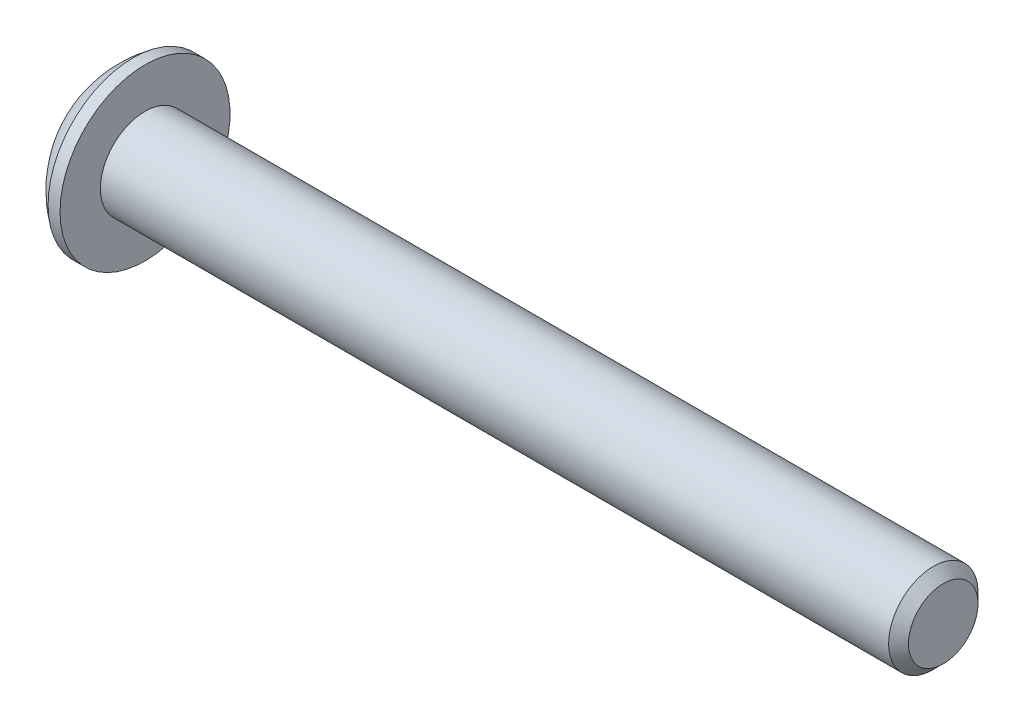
ISO-10303-21;
HEADER;
FILE_DESCRIPTION(('STEP AP214'),'2;1');
FILE_NAME('part.step','',(''),(''),'','','');
FILE_SCHEMA(('AUTOMOTIVE_DESIGN { 1 0 10303 214 1 1 1 1 }'));
ENDSEC;
DATA;
#1=APPLICATION_CONTEXT('core data for automotive mechanical design processes');
#2=APPLICATION_PROTOCOL_DEFINITION('international standard','automotive_design',2000,#1);
#3=PRODUCT_CONTEXT('',#1,'mechanical');
#4=PRODUCT('Part','Part','',(#3));
#5=PRODUCT_RELATED_PRODUCT_CATEGORY('part','',(#4));
#6=PRODUCT_DEFINITION_FORMATION('','',#4);
#7=PRODUCT_DEFINITION_CONTEXT('part definition',#1,'design');
#8=PRODUCT_DEFINITION('design','',#6,#7);
#9=PRODUCT_DEFINITION_SHAPE('','',#8);
#10=(LENGTH_UNIT() NAMED_UNIT(*) SI_UNIT(.MILLI.,.METRE.));
#11=(NAMED_UNIT(*) PLANE_ANGLE_UNIT() SI_UNIT($,.RADIAN.));
#12=(NAMED_UNIT(*) SI_UNIT($,.STERADIAN.) SOLID_ANGLE_UNIT());
#13=UNCERTAINTY_MEASURE_WITH_UNIT(LENGTH_MEASURE(1.E-05),#10,'distance_accuracy_value','');
#14=(GEOMETRIC_REPRESENTATION_CONTEXT(3) GLOBAL_UNCERTAINTY_ASSIGNED_CONTEXT((#13)) GLOBAL_UNIT_ASSIGNED_CONTEXT((#10,
#11,#12)) REPRESENTATION_CONTEXT('',''));
#15=CARTESIAN_POINT('',(0.,0.,0.));
#16=DIRECTION('',(0.,0.,1.));
#17=DIRECTION('',(1.,0.,0.));
#18=AXIS2_PLACEMENT_3D('',#15,#16,#17);
#19=CARTESIAN_POINT('',(0.,0.,0.));
#20=DIRECTION('',(-1.,0.,0.));
#21=DIRECTION('',(0.,0.,1.));
#22=AXIS2_PLACEMENT_3D('',#19,#20,#21);
#23=PLANE('',#22);
#24=CARTESIAN_POINT('',(0.,0.,0.));
#25=DIRECTION('',(-1.,0.,0.));
#26=DIRECTION('',(0.,0.,1.));
#27=AXIS2_PLACEMENT_3D('',#24,#25,#26);
#28=CIRCLE('',#27,1.35255);
#29=CARTESIAN_POINT('',(0.,1.35255,0.));
#30=VERTEX_POINT('',#29);
#31=EDGE_CURVE('E11',#30,#30,#28,.T.);
#32=ORIENTED_EDGE('',*,*,#31,.T.);
#33=EDGE_LOOP('',(#32));
#34=FACE_BOUND('',#33,.T.);
#35=CARTESIAN_POINT('',(0.,0.,0.));
#36=DIRECTION('',(1.,0.,0.));
#37=DIRECTION('',(0.,0.,1.));
#38=AXIS2_PLACEMENT_3D('',#35,#36,#37);
#39=CIRCLE('',#38,0.9398);
#40=CARTESIAN_POINT('',(0.,0.634761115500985,-0.693038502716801));
#41=VERTEX_POINT('',#40);
#42=CARTESIAN_POINT('',(0.,0.917569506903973,-0.203199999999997));
#43=VERTEX_POINT('',#42);
#44=EDGE_CURVE('E332',#41,#43,#39,.T.);
#45=ORIENTED_EDGE('',*,*,#44,.T.);
#46=DIRECTION('',(0.,-1.,0.));
#47=VECTOR('',#46,1.);
#48=CARTESIAN_POINT('',(0.,0.786990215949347,-0.203199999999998));
#49=LINE('',#48,#47);
#50=CARTESIAN_POINT('',(0.,0.786990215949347,-0.203199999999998));
#51=VERTEX_POINT('',#50);
#52=EDGE_CURVE('E291',#43,#51,#49,.T.);
#53=ORIENTED_EDGE('',*,*,#52,.T.);
#54=CARTESIAN_POINT('',(0.,0.,0.));
#55=DIRECTION('',(1.,0.,0.));
#56=DIRECTION('',(0.,0.86602540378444,-0.499999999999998));
#57=AXIS2_PLACEMENT_3D('',#54,#55,#56);
#58=CIRCLE('',#57,0.812799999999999);
#59=CARTESIAN_POINT('',(0.,0.786990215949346,0.203200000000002));
#60=VERTEX_POINT('',#59);
#61=EDGE_CURVE('E294',#51,#60,#58,.T.);
#62=ORIENTED_EDGE('',*,*,#61,.T.);
#63=DIRECTION('',(0.,1.,0.));
#64=VECTOR('',#63,1.);
#65=CARTESIAN_POINT('',(0.,0.786990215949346,0.203200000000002));
#66=LINE('',#65,#64);
#67=CARTESIAN_POINT('',(0.,0.917569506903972,0.203200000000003));
#68=VERTEX_POINT('',#67);
#69=EDGE_CURVE('E297',#60,#68,#66,.T.);
#70=ORIENTED_EDGE('',*,*,#69,.T.);
#71=CARTESIAN_POINT('',(0.,0.,0.));
#72=DIRECTION('',(1.,0.,0.));
#73=DIRECTION('',(0.,-0.86602540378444,0.499999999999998));
#74=AXIS2_PLACEMENT_3D('',#71,#72,#73);
#75=CIRCLE('',#74,0.9398);
#76=CARTESIAN_POINT('',(0.,0.634761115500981,0.693038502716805));
#77=VERTEX_POINT('',#76);
#78=EDGE_CURVE('E300',#68,#77,#75,.T.);
#79=ORIENTED_EDGE('',*,*,#78,.T.);
#80=DIRECTION('',(0.,-0.499999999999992,-0.866025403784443));
#81=VECTOR('',#80,1.);
#82=CARTESIAN_POINT('',(0.,0.569471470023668,0.579953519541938));
#83=LINE('',#82,#81);
#84=CARTESIAN_POINT('',(0.,0.569471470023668,0.579953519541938));
#85=VERTEX_POINT('',#84);
#86=EDGE_CURVE('E263',#77,#85,#83,.T.);
#87=ORIENTED_EDGE('',*,*,#86,.T.);
#88=CARTESIAN_POINT('',(0.,0.,0.));
#89=DIRECTION('',(1.,0.,0.));
#90=DIRECTION('',(0.,0.866025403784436,0.500000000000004));
#91=AXIS2_PLACEMENT_3D('',#88,#89,#90);
#92=CIRCLE('',#91,0.812799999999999);
#93=CARTESIAN_POINT('',(0.,0.217518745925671,0.783153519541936));
#94=VERTEX_POINT('',#93);
#95=EDGE_CURVE('E266',#85,#94,#92,.T.);
#96=ORIENTED_EDGE('',*,*,#95,.T.);
#97=DIRECTION('',(0.,0.499999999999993,0.866025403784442));
#98=VECTOR('',#97,1.);
#99=CARTESIAN_POINT('',(0.,0.217518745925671,0.783153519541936));
#100=LINE('',#99,#98);
#101=CARTESIAN_POINT('',(0.,0.282808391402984,0.896238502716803));
#102=VERTEX_POINT('',#101);
#103=EDGE_CURVE('E269',#94,#102,#100,.T.);
#104=ORIENTED_EDGE('',*,*,#103,.T.);
#105=CARTESIAN_POINT('',(0.,0.,0.));
#106=DIRECTION('',(1.,0.,0.));
#107=DIRECTION('',(0.,-0.866025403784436,-0.500000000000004));
#108=AXIS2_PLACEMENT_3D('',#105,#106,#107);
#109=CIRCLE('',#108,0.9398);
#110=CARTESIAN_POINT('',(0.,-0.282808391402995,0.896238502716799));
#111=VERTEX_POINT('',#110);
#112=EDGE_CURVE('E272',#102,#111,#109,.T.);
#113=ORIENTED_EDGE('',*,*,#112,.T.);
#114=DIRECTION('',(0.,0.50000000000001,-0.866025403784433));
#115=VECTOR('',#114,1.);
#116=CARTESIAN_POINT('',(0.,-0.217518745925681,0.783153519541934));
#117=LINE('',#116,#115);
#118=CARTESIAN_POINT('',(0.,-0.217518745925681,0.783153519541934));
#119=VERTEX_POINT('',#118);
#120=EDGE_CURVE('E235',#111,#119,#117,.T.);
#121=ORIENTED_EDGE('',*,*,#120,.T.);
#122=CARTESIAN_POINT('',(0.,0.,0.));
#123=DIRECTION('',(1.,0.,0.));
#124=DIRECTION('',(0.,0.,1.));
#125=AXIS2_PLACEMENT_3D('',#122,#123,#124);
#126=CIRCLE('',#125,0.812799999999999);
#127=CARTESIAN_POINT('',(0.,-0.569471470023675,0.579953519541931));
#128=VERTEX_POINT('',#127);
#129=EDGE_CURVE('E238',#119,#128,#126,.T.);
#130=ORIENTED_EDGE('',*,*,#129,.T.);
#131=DIRECTION('',(0.,-0.500000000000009,0.866025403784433));
#132=VECTOR('',#131,1.);
#133=CARTESIAN_POINT('',(0.,-0.569471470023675,0.579953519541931));
#134=LINE('',#133,#132);
#135=CARTESIAN_POINT('',(0.,-0.63476111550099,0.693038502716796));
#136=VERTEX_POINT('',#135);
#137=EDGE_CURVE('E241',#128,#136,#134,.T.);
#138=ORIENTED_EDGE('',*,*,#137,.T.);
#139=CARTESIAN_POINT('',(0.,0.,0.));
#140=DIRECTION('',(1.,0.,0.));
#141=DIRECTION('',(0.,0.,-1.));
#142=AXIS2_PLACEMENT_3D('',#139,#140,#141);
#143=CIRCLE('',#142,0.9398);
#144=CARTESIAN_POINT('',(0.,-0.917569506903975,0.203199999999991));
#145=VERTEX_POINT('',#144);
#146=EDGE_CURVE('E244',#136,#145,#143,.T.);
#147=ORIENTED_EDGE('',*,*,#146,.T.);
#148=DIRECTION('',(0.,1.,0.));
#149=VECTOR('',#148,1.);
#150=CARTESIAN_POINT('',(0.,-0.786990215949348,0.203199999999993));
#151=LINE('',#150,#149);
#152=CARTESIAN_POINT('',(0.,-0.786990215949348,0.203199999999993));
#153=VERTEX_POINT('',#152);
#154=EDGE_CURVE('E200',#145,#153,#151,.T.);
#155=ORIENTED_EDGE('',*,*,#154,.T.);
#156=CARTESIAN_POINT('',(0.,0.,0.));
#157=DIRECTION('',(1.,0.,0.));
#158=DIRECTION('',(0.,-0.866025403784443,0.499999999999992));
#159=AXIS2_PLACEMENT_3D('',#156,#157,#158);
#160=CIRCLE('',#159,0.812799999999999);
#161=CARTESIAN_POINT('',(0.,-0.786990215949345,-0.203200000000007));
#162=VERTEX_POINT('',#161);
#163=EDGE_CURVE('E219',#153,#162,#160,.T.);
#164=ORIENTED_EDGE('',*,*,#163,.T.);
#165=DIRECTION('',(0.,-1.,0.));
#166=VECTOR('',#165,1.);
#167=CARTESIAN_POINT('',(0.,-0.786990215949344,-0.203200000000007));
#168=LINE('',#167,#166);
#169=CARTESIAN_POINT('',(0.,-0.917569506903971,-0.203200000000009));
#170=VERTEX_POINT('',#169);
#171=EDGE_CURVE('E214',#162,#170,#168,.T.);
#172=ORIENTED_EDGE('',*,*,#171,.T.);
#173=CARTESIAN_POINT('',(0.,0.,0.));
#174=DIRECTION('',(1.,0.,0.));
#175=DIRECTION('',(0.,0.866025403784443,-0.499999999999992));
#176=AXIS2_PLACEMENT_3D('',#173,#174,#175);
#177=CIRCLE('',#176,0.9398);
#178=CARTESIAN_POINT('',(0.,-0.634761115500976,-0.693038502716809));
#179=VERTEX_POINT('',#178);
#180=EDGE_CURVE('E194',#170,#179,#177,.T.);
#181=ORIENTED_EDGE('',*,*,#180,.T.);
#182=DIRECTION('',(0.,0.499999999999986,0.866025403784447));
#183=VECTOR('',#182,1.);
#184=CARTESIAN_POINT('',(0.,-0.569471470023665,-0.579953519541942));
#185=LINE('',#184,#183);
#186=CARTESIAN_POINT('',(0.,-0.569471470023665,-0.579953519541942));
#187=VERTEX_POINT('',#186);
#188=EDGE_CURVE('E204',#179,#187,#185,.T.);
#189=ORIENTED_EDGE('',*,*,#188,.T.);
#190=CARTESIAN_POINT('',(0.,0.,0.));
#191=DIRECTION('',(1.,0.,0.));
#192=DIRECTION('',(0.,-0.866025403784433,-0.50000000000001));
#193=AXIS2_PLACEMENT_3D('',#190,#191,#192);
#194=CIRCLE('',#193,0.812799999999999);
#195=CARTESIAN_POINT('',(0.,-0.217518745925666,-0.783153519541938));
#196=VERTEX_POINT('',#195);
#197=EDGE_CURVE('E210',#187,#196,#194,.T.);
#198=ORIENTED_EDGE('',*,*,#197,.T.);
#199=DIRECTION('',(0.,-0.499999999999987,-0.866025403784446));
#200=VECTOR('',#199,1.);
#201=CARTESIAN_POINT('',(0.,-0.217518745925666,-0.783153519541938));
#202=LINE('',#201,#200);
#203=CARTESIAN_POINT('',(0.,-0.282808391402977,-0.896238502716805));
#204=VERTEX_POINT('',#203);
#205=EDGE_CURVE('E655',#196,#204,#202,.T.);
#206=ORIENTED_EDGE('',*,*,#205,.T.);
#207=CARTESIAN_POINT('',(0.,0.,0.));
#208=DIRECTION('',(1.,0.,0.));
#209=DIRECTION('',(0.,0.,-1.));
#210=AXIS2_PLACEMENT_3D('',#207,#208,#209);
#211=CIRCLE('',#210,0.9398);
#212=CARTESIAN_POINT('',(0.,0.282808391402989,-0.896238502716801));
#213=VERTEX_POINT('',#212);
#214=EDGE_CURVE('E320',#204,#213,#211,.T.);
#215=ORIENTED_EDGE('',*,*,#214,.T.);
#216=DIRECTION('',(0.,-0.500000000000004,0.866025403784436));
#217=VECTOR('',#216,1.);
#218=CARTESIAN_POINT('',(0.,0.217518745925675,-0.783153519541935));
#219=LINE('',#218,#217);
#220=CARTESIAN_POINT('',(0.,0.217518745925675,-0.783153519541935));
#221=VERTEX_POINT('',#220);
#222=EDGE_CURVE('E323',#213,#221,#219,.T.);
#223=ORIENTED_EDGE('',*,*,#222,.T.);
#224=CARTESIAN_POINT('',(0.,0.,0.));
#225=DIRECTION('',(1.,0.,0.));
#226=DIRECTION('',(0.,0.,-1.));
#227=AXIS2_PLACEMENT_3D('',#224,#225,#226);
#228=CIRCLE('',#227,0.812799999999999);
#229=CARTESIAN_POINT('',(0.,0.569471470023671,-0.579953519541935));
#230=VERTEX_POINT('',#229);
#231=EDGE_CURVE('E326',#221,#230,#228,.T.);
#232=ORIENTED_EDGE('',*,*,#231,.T.);
#233=DIRECTION('',(0.,0.500000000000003,-0.866025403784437));
#234=VECTOR('',#233,1.);
#235=CARTESIAN_POINT('',(0.,0.569471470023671,-0.579953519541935));
#236=LINE('',#235,#234);
#237=EDGE_CURVE('E329',#230,#41,#236,.T.);
#238=ORIENTED_EDGE('',*,*,#237,.T.);
#239=EDGE_LOOP('',(#45,#53,#62,#70,#79,#87,#96,#104,#113,#121,#130,#138,#147,#155,#164,#172,
#181,#189,#198,#206,#215,#223,#232,#238));
#240=FACE_BOUND('',#239,.T.);
#241=ADVANCED_FACE('F28',(#34,#240),#23,.T.);
#242=CARTESIAN_POINT('',(3.01413934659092,0.,0.));
#243=DIRECTION('',(-1.,0.,0.));
#244=DIRECTION('',(0.,1.,0.));
#245=AXIS2_PLACEMENT_3D('',#242,#243,#244);
#246=SPHERICAL_SURFACE('',#245,3.30369906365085);
#247=CARTESIAN_POINT('',(1.1176,0.,0.));
#248=DIRECTION('',(-1.,0.,0.));
#249=DIRECTION('',(0.,0.,1.));
#250=AXIS2_PLACEMENT_3D('',#247,#248,#249);
#251=CIRCLE('',#250,2.7051);
#252=CARTESIAN_POINT('',(1.1176,2.7051,0.));
#253=VERTEX_POINT('',#252);
#254=EDGE_CURVE('E35',#253,#253,#251,.T.);
#255=CARTESIAN_POINT('',(1.1176,2.7051,0.));
#256=CARTESIAN_POINT('',(1.10245333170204,2.69448072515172,0.));
#257=CARTESIAN_POINT('',(1.08739587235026,2.68373420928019,0.));
#258=CARTESIAN_POINT('',(1.05746357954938,2.6619897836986,0.));
#259=CARTESIAN_POINT('',(1.04258874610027,2.65099187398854,0.));
#260=CARTESIAN_POINT('',(1.01302591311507,2.62874774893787,0.));
#261=CARTESIAN_POINT('',(0.998337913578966,2.61750153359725,0.));
#262=CARTESIAN_POINT('',(0.96915288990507,2.59476397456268,0.));
#263=CARTESIAN_POINT('',(0.954655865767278,2.58327263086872,0.));
#264=CARTESIAN_POINT('',(0.925856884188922,2.56004805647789,0.));
#265=CARTESIAN_POINT('',(0.911554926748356,2.54831482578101,0.));
#266=CARTESIAN_POINT('',(0.88315011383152,2.52460978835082,0.));
#267=CARTESIAN_POINT('',(0.86904725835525,2.51263798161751,0.));
#268=CARTESIAN_POINT('',(0.841044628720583,2.48845917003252,0.));
#269=CARTESIAN_POINT('',(0.827144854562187,2.47625216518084,0.));
#270=CARTESIAN_POINT('',(0.799552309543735,2.45160640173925,0.));
#271=CARTESIAN_POINT('',(0.78585953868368,2.43916764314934,0.));
#272=CARTESIAN_POINT('',(0.758684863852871,2.41406188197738,0.));
#273=CARTESIAN_POINT('',(0.745202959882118,2.40139487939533,0.));
#274=CARTESIAN_POINT('',(0.71845382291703,2.37583620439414,0.));
#275=CARTESIAN_POINT('',(0.705186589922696,2.36294453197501,0.));
#276=CARTESIAN_POINT('',(0.678870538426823,2.3369401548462,0.));
#277=CARTESIAN_POINT('',(0.665821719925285,2.32382745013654,0.));
#278=CARTESIAN_POINT('',(0.639946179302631,2.2973847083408,0.));
#279=CARTESIAN_POINT('',(0.627119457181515,2.28405467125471,0.));
#280=CARTESIAN_POINT('',(0.601691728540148,2.25718102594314,0.));
#281=CARTESIAN_POINT('',(0.589090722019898,2.24363741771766,0.));
#282=CARTESIAN_POINT('',(0.564117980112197,2.21634045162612,0.));
#283=CARTESIAN_POINT('',(0.551746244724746,2.20258709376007,0.));
#284=CARTESIAN_POINT('',(0.52723553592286,2.17487450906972,0.));
#285=CARTESIAN_POINT('',(0.515096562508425,2.16091528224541,0.));
#286=CARTESIAN_POINT('',(0.491054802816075,2.13279489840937,0.));
#287=CARTESIAN_POINT('',(0.47915201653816,2.11863374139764,0.));
#288=CARTESIAN_POINT('',(0.455585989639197,2.09011349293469,0.));
#289=CARTESIAN_POINT('',(0.443922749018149,2.07575440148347,0.));
#290=CARTESIAN_POINT('',(0.420839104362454,2.04684233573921,0.));
#291=CARTESIAN_POINT('',(0.409418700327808,2.03228936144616,0.));
#292=CARTESIAN_POINT('',(0.386823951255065,2.00299363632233,0.));
#293=CARTESIAN_POINT('',(0.375649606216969,1.98825088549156,0.));
#294=CARTESIAN_POINT('',(0.353550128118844,1.95857976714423,0.));
#295=CARTESIAN_POINT('',(0.342624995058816,1.94365139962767,0.));
#296=CARTESIAN_POINT('',(0.321027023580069,1.91361326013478,0.));
#297=CARTESIAN_POINT('',(0.310354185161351,1.89850348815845,0.));
#298=CARTESIAN_POINT('',(0.289263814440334,1.86810680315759,0.));
#299=CARTESIAN_POINT('',(0.278846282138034,1.85281989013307,0.));
#300=CARTESIAN_POINT('',(0.258269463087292,1.82207323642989,0.));
#301=CARTESIAN_POINT('',(0.24811017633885,1.80661349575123,0.));
#302=CARTESIAN_POINT('',(0.228052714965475,1.77552554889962,0.));
#303=CARTESIAN_POINT('',(0.218154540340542,1.75989734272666,0.));
#304=CARTESIAN_POINT('',(0.19862209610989,1.72847687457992,0.));
#305=CARTESIAN_POINT('',(0.18898782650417,1.71268461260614,0.));
#306=CARTESIAN_POINT('',(0.169985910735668,1.68094048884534,0.));
#307=CARTESIAN_POINT('',(0.160618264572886,1.66498862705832,0.));
#308=CARTESIAN_POINT('',(0.14215223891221,1.63292980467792,0.));
#309=CARTESIAN_POINT('',(0.133053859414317,1.61682284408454,0.));
#310=CARTESIAN_POINT('',(0.115128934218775,1.58445836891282,0.));
#311=CARTESIAN_POINT('',(0.106302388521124,1.56820085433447,0.));
#312=CARTESIAN_POINT('',(0.0889236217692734,1.53553985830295,0.));
#313=CARTESIAN_POINT('',(0.0803714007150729,1.51913637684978,0.));
#314=CARTESIAN_POINT('',(0.0635436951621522,1.48618807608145,0.));
#315=CARTESIAN_POINT('',(0.055268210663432,1.46964325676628,0.));
#316=CARTESIAN_POINT('',(0.0389963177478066,1.43641694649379,0.));
#317=CARTESIAN_POINT('',(0.0309999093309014,1.41973545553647,0.));
#318=CARTESIAN_POINT('',(0.015288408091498,1.38624051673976,0.));
#319=CARTESIAN_POINT('',(0.00757331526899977,1.36942706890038,0.));
#320=CARTESIAN_POINT('',(0.,1.35255,0.));
#321=B_SPLINE_CURVE_WITH_KNOTS('',3,(#255,#256,#257,#258,#259,#260,#261,#262,#263,#264,#265,
#266,#267,#268,#269,#270,#271,#272,#273,#274,#275,#276,#277,#278,#279,#280,#281,#282,#283,#284,
#285,#286,#287,#288,#289,#290,#291,#292,#293,#294,#295,#296,#297,#298,#299,#300,#301,#302,#303,
#304,#305,#306,#307,#308,#309,#310,#311,#312,#313,#314,#315,#316,#317,#318,#319,#320),
.UNSPECIFIED.,.F.,.F.,(4,2,2,2,2,2,2,2,2,2,2,2,2,2,2,2,2,2,2,2,2,2,2,2,2,2,2,2,2,2,2,2,4),(0.,
0.0554945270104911,0.110989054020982,0.166483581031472,0.221978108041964,0.277472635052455,
0.332967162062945,0.388461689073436,0.443956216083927,0.499450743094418,0.554945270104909,
0.6104397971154,0.66593432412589,0.721428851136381,0.776923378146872,0.832417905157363,
0.887912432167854,0.943406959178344,0.998901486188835,1.05439601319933,1.10989054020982,
1.16538506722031,1.2208795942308,1.27637412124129,1.33186864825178,1.38736317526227,
1.44285770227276,1.49835222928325,1.55384675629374,1.60934128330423,1.66483581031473,
1.72033033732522,1.77582486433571),.UNSPECIFIED.);
#322=EDGE_CURVE('BSEAM364',#253,#30,#321,.T.);
#323=ORIENTED_EDGE('',*,*,#254,.T.);
#324=ORIENTED_EDGE('',*,*,#31,.F.);
#325=ORIENTED_EDGE('',*,*,#322,.T.);
#326=ORIENTED_EDGE('',*,*,#322,.F.);
#327=EDGE_LOOP('',(#323,#325,#324,#326));
#328=FACE_BOUND('',#327,.T.);
#329=ADVANCED_FACE('F364',(#328),#246,.T.);
#330=CARTESIAN_POINT('',(0.,0.,0.));
#331=DIRECTION('',(-1.,0.,0.));
#332=DIRECTION('',(0.,0.,1.));
#333=AXIS2_PLACEMENT_3D('',#330,#331,#332);
#334=CYLINDRICAL_SURFACE('',#333,2.7051);
#335=ORIENTED_EDGE('',*,*,#254,.F.);
#336=EDGE_LOOP('',(#335));
#337=FACE_BOUND('',#336,.T.);
#338=CARTESIAN_POINT('',(1.4986,0.,0.));
#339=DIRECTION('',(-1.,0.,0.));
#340=DIRECTION('',(0.,0.,1.));
#341=AXIS2_PLACEMENT_3D('',#338,#339,#340);
#342=CIRCLE('',#341,2.7051);
#343=CARTESIAN_POINT('',(1.4986,0.,2.7051));
#344=VERTEX_POINT('',#343);
#345=EDGE_CURVE('E359',#344,#344,#342,.T.);
#346=ORIENTED_EDGE('',*,*,#345,.T.);
#347=EDGE_LOOP('',(#346));
#348=FACE_BOUND('',#347,.T.);
#349=ADVANCED_FACE('F367',(#337,#348),#334,.T.);
#350=CARTESIAN_POINT('',(1.4986,1.42239999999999,0.));
#351=DIRECTION('',(-1.,0.,0.));
#352=DIRECTION('',(0.,0.,1.));
#353=AXIS2_PLACEMENT_3D('',#350,#351,#352);
#354=PLANE('',#353);
#355=ORIENTED_EDGE('',*,*,#345,.F.);
#356=EDGE_LOOP('',(#355));
#357=FACE_BOUND('',#356,.T.);
#358=CARTESIAN_POINT('',(1.4986,0.,0.));
#359=DIRECTION('',(-1.,0.,0.));
#360=DIRECTION('',(0.,0.,1.));
#361=AXIS2_PLACEMENT_3D('',#358,#359,#360);
#362=CIRCLE('',#361,1.42239999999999);
#363=CARTESIAN_POINT('',(1.4986,0.,1.42239999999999));
#364=VERTEX_POINT('',#363);
#365=EDGE_CURVE('E356',#364,#364,#362,.T.);
#366=ORIENTED_EDGE('',*,*,#365,.T.);
#367=EDGE_LOOP('',(#366));
#368=FACE_BOUND('',#367,.T.);
#369=ADVANCED_FACE('F370',(#357,#368),#354,.F.);
#370=CARTESIAN_POINT('',(0.,0.,0.));
#371=DIRECTION('',(-1.,0.,0.));
#372=DIRECTION('',(0.,0.,1.));
#373=AXIS2_PLACEMENT_3D('',#370,#371,#372);
#374=CYLINDRICAL_SURFACE('',#373,1.4224);
#375=ORIENTED_EDGE('',*,*,#365,.F.);
#376=EDGE_LOOP('',(#375));
#377=FACE_BOUND('',#376,.T.);
#378=CARTESIAN_POINT('',(26.58237,0.,0.));
#379=DIRECTION('',(-1.,0.,0.));
#380=DIRECTION('',(0.,0.,1.));
#381=AXIS2_PLACEMENT_3D('',#378,#379,#380);
#382=CIRCLE('',#381,1.4224);
#383=CARTESIAN_POINT('',(26.58237,0.,1.4224));
#384=VERTEX_POINT('',#383);
#385=EDGE_CURVE('E353',#384,#384,#382,.T.);
#386=ORIENTED_EDGE('',*,*,#385,.T.);
#387=EDGE_LOOP('',(#386));
#388=FACE_BOUND('',#387,.T.);
#389=ADVANCED_FACE('F376',(#377,#388),#374,.T.);
#390=CARTESIAN_POINT('',(26.8986,0.,0.));
#391=DIRECTION('',(-1.,0.,0.));
#392=DIRECTION('',(0.,0.,1.));
#393=AXIS2_PLACEMENT_3D('',#390,#391,#392);
#394=CONICAL_SURFACE('',#393,1.10617,0.785398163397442);
#395=ORIENTED_EDGE('',*,*,#385,.F.);
#396=EDGE_LOOP('',(#395));
#397=FACE_BOUND('',#396,.T.);
#398=CARTESIAN_POINT('',(26.8986,0.,0.));
#399=DIRECTION('',(-1.,0.,0.));
#400=DIRECTION('',(0.,0.,1.));
#401=AXIS2_PLACEMENT_3D('',#398,#399,#400);
#402=CIRCLE('',#401,1.10617);
#403=CARTESIAN_POINT('',(26.8986,0.,1.10617));
#404=VERTEX_POINT('',#403);
#405=EDGE_CURVE('E350',#404,#404,#402,.T.);
#406=ORIENTED_EDGE('',*,*,#405,.T.);
#407=EDGE_LOOP('',(#406));
#408=FACE_BOUND('',#407,.T.);
#409=ADVANCED_FACE('F382',(#397,#408),#394,.T.);
#410=CARTESIAN_POINT('',(26.8986,0.,0.));
#411=DIRECTION('',(-1.,0.,0.));
#412=DIRECTION('',(0.,0.,1.));
#413=AXIS2_PLACEMENT_3D('',#410,#411,#412);
#414=PLANE('',#413);
#415=ORIENTED_EDGE('',*,*,#405,.F.);
#416=EDGE_LOOP('',(#415));
#417=FACE_BOUND('',#416,.T.);
#418=ADVANCED_FACE('F388',(#417),#414,.F.);
#419=CARTESIAN_POINT('',(0.889,0.,0.));
#420=DIRECTION('',(-1.,0.,0.));
#421=DIRECTION('',(0.,0.,1.));
#422=AXIS2_PLACEMENT_3D('',#419,#420,#421);
#423=CYLINDRICAL_SURFACE('',#422,0.9398);
#424=ORIENTED_EDGE('',*,*,#214,.F.);
#425=DIRECTION('',(-1.,0.,0.));
#426=VECTOR('',#425,1.);
#427=CARTESIAN_POINT('',(0.889,-0.282808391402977,-0.896238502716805));
#428=LINE('',#427,#426);
#429=CARTESIAN_POINT('',(0.889,-0.282808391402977,-0.896238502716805));
#430=VERTEX_POINT('',#429);
#431=EDGE_CURVE('E660',#430,#204,#428,.T.);
#432=ORIENTED_EDGE('',*,*,#431,.F.);
#433=CARTESIAN_POINT('',(0.889,0.,0.));
#434=DIRECTION('',(1.,0.,0.));
#435=DIRECTION('',(0.,0.,-1.));
#436=AXIS2_PLACEMENT_3D('',#433,#434,#435);
#437=CIRCLE('',#436,0.9398);
#438=CARTESIAN_POINT('',(0.889,0.282808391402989,-0.896238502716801));
#439=VERTEX_POINT('',#438);
#440=EDGE_CURVE('E334',#430,#439,#437,.T.);
#441=ORIENTED_EDGE('',*,*,#440,.T.);
#442=DIRECTION('',(-1.,0.,0.));
#443=VECTOR('',#442,1.);
#444=CARTESIAN_POINT('',(0.889,0.282808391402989,-0.896238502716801));
#445=LINE('',#444,#443);
#446=EDGE_CURVE('E348',#439,#213,#445,.T.);
#447=ORIENTED_EDGE('',*,*,#446,.T.);
#448=EDGE_LOOP('',(#424,#432,#441,#447));
#449=FACE_BOUND('',#448,.T.);
#450=ADVANCED_FACE('F393',(#449),#423,.F.);
#451=CARTESIAN_POINT('',(0.889,0.217518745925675,-0.783153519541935));
#452=DIRECTION('',(0.,-0.866025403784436,-0.500000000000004));
#453=DIRECTION('',(0.,0.500000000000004,-0.866025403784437));
#454=AXIS2_PLACEMENT_3D('',#451,#452,#453);
#455=PLANE('',#454);
#456=ORIENTED_EDGE('',*,*,#222,.F.);
#457=ORIENTED_EDGE('',*,*,#446,.F.);
#458=DIRECTION('',(0.,-0.500000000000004,0.866025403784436));
#459=VECTOR('',#458,1.);
#460=CARTESIAN_POINT('',(0.889,0.217518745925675,-0.783153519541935));
#461=LINE('',#460,#459);
#462=CARTESIAN_POINT('',(0.889,0.217518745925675,-0.783153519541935));
#463=VERTEX_POINT('',#462);
#464=EDGE_CURVE('E336',#439,#463,#461,.T.);
#465=ORIENTED_EDGE('',*,*,#464,.T.);
#466=DIRECTION('',(-1.,0.,0.));
#467=VECTOR('',#466,1.);
#468=CARTESIAN_POINT('',(0.889,0.217518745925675,-0.783153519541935));
#469=LINE('',#468,#467);
#470=EDGE_CURVE('E346',#463,#221,#469,.T.);
#471=ORIENTED_EDGE('',*,*,#470,.T.);
#472=EDGE_LOOP('',(#456,#457,#465,#471));
#473=FACE_BOUND('',#472,.T.);
#474=ADVANCED_FACE('F399',(#473),#455,.T.);
#475=CARTESIAN_POINT('',(0.889,0.,0.));
#476=DIRECTION('',(-1.,0.,0.));
#477=DIRECTION('',(0.,0.,1.));
#478=AXIS2_PLACEMENT_3D('',#475,#476,#477);
#479=CYLINDRICAL_SURFACE('',#478,0.812799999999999);
#480=ORIENTED_EDGE('',*,*,#231,.F.);
#481=ORIENTED_EDGE('',*,*,#470,.F.);
#482=CARTESIAN_POINT('',(0.889,0.,0.));
#483=DIRECTION('',(1.,0.,0.));
#484=DIRECTION('',(0.,0.,-1.));
#485=AXIS2_PLACEMENT_3D('',#482,#483,#484);
#486=CIRCLE('',#485,0.812799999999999);
#487=CARTESIAN_POINT('',(0.889,0.569471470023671,-0.579953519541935));
#488=VERTEX_POINT('',#487);
#489=EDGE_CURVE('E50',#463,#488,#486,.T.);
#490=ORIENTED_EDGE('',*,*,#489,.T.);
#491=DIRECTION('',(-1.,0.,0.));
#492=VECTOR('',#491,1.);
#493=CARTESIAN_POINT('',(0.889,0.569471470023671,-0.579953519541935));
#494=LINE('',#493,#492);
#495=EDGE_CURVE('E344',#488,#230,#494,.T.);
#496=ORIENTED_EDGE('',*,*,#495,.T.);
#497=EDGE_LOOP('',(#480,#481,#490,#496));
#498=FACE_BOUND('',#497,.T.);
#499=ADVANCED_FACE('F442',(#498),#479,.F.);
#500=CARTESIAN_POINT('',(0.889,0.569471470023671,-0.579953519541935));
#501=DIRECTION('',(0.,0.866025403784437,0.500000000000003));
#502=DIRECTION('',(0.,-0.500000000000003,0.866025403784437));
#503=AXIS2_PLACEMENT_3D('',#500,#501,#502);
#504=PLANE('',#503);
#505=ORIENTED_EDGE('',*,*,#237,.F.);
#506=ORIENTED_EDGE('',*,*,#495,.F.);
#507=DIRECTION('',(0.,0.500000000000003,-0.866025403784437));
#508=VECTOR('',#507,1.);
#509=CARTESIAN_POINT('',(0.889,0.569471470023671,-0.579953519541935));
#510=LINE('',#509,#508);
#511=CARTESIAN_POINT('',(0.889,0.634761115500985,-0.693038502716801));
#512=VERTEX_POINT('',#511);
#513=EDGE_CURVE('E42',#488,#512,#510,.T.);
#514=ORIENTED_EDGE('',*,*,#513,.T.);
#515=DIRECTION('',(-1.,0.,0.));
#516=VECTOR('',#515,1.);
#517=CARTESIAN_POINT('',(0.889,0.634761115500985,-0.693038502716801));
#518=LINE('',#517,#516);
#519=EDGE_CURVE('E342',#512,#41,#518,.T.);
#520=ORIENTED_EDGE('',*,*,#519,.T.);
#521=EDGE_LOOP('',(#505,#506,#514,#520));
#522=FACE_BOUND('',#521,.T.);
#523=ADVANCED_FACE('F450',(#522),#504,.T.);
#524=CARTESIAN_POINT('',(0.889,0.,0.));
#525=DIRECTION('',(-1.,0.,0.));
#526=DIRECTION('',(0.,0.,1.));
#527=AXIS2_PLACEMENT_3D('',#524,#525,#526);
#528=CYLINDRICAL_SURFACE('',#527,0.9398);
#529=ORIENTED_EDGE('',*,*,#44,.F.);
#530=ORIENTED_EDGE('',*,*,#519,.F.);
#531=CARTESIAN_POINT('',(0.889,0.,0.));
#532=DIRECTION('',(1.,0.,0.));
#533=DIRECTION('',(0.,0.,1.));
#534=AXIS2_PLACEMENT_3D('',#531,#532,#533);
#535=CIRCLE('',#534,0.9398);
#536=CARTESIAN_POINT('',(0.889,0.917569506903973,-0.203199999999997));
#537=VERTEX_POINT('',#536);
#538=EDGE_CURVE('E340',#512,#537,#535,.T.);
#539=ORIENTED_EDGE('',*,*,#538,.T.);
#540=DIRECTION('',(-1.,0.,0.));
#541=VECTOR('',#540,1.);
#542=CARTESIAN_POINT('',(0.889,0.917569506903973,-0.203199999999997));
#543=LINE('',#542,#541);
#544=EDGE_CURVE('E317',#537,#43,#543,.T.);
#545=ORIENTED_EDGE('',*,*,#544,.T.);
#546=EDGE_LOOP('',(#529,#530,#539,#545));
#547=FACE_BOUND('',#546,.T.);
#548=ADVANCED_FACE('F456',(#547),#528,.F.);
#549=CARTESIAN_POINT('',(0.889,0.,0.));
#550=DIRECTION('',(-1.,0.,0.));
#551=DIRECTION('',(0.,0.,1.));
#552=AXIS2_PLACEMENT_3D('',#549,#550,#551);
#553=PLANE('',#552);
#554=DIRECTION('',(0.,-1.,0.));
#555=VECTOR('',#554,1.);
#556=CARTESIAN_POINT('',(0.889,0.786990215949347,-0.203199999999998));
#557=LINE('',#556,#555);
#558=CARTESIAN_POINT('',(0.889,0.786990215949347,-0.203199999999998));
#559=VERTEX_POINT('',#558);
#560=EDGE_CURVE('E303',#537,#559,#557,.T.);
#561=ORIENTED_EDGE('',*,*,#560,.F.);
#562=ORIENTED_EDGE('',*,*,#538,.F.);
#563=ORIENTED_EDGE('',*,*,#513,.F.);
#564=ORIENTED_EDGE('',*,*,#489,.F.);
#565=ORIENTED_EDGE('',*,*,#464,.F.);
#566=ORIENTED_EDGE('',*,*,#440,.F.);
#567=DIRECTION('',(0.,-0.499999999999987,-0.866025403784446));
#568=VECTOR('',#567,1.);
#569=CARTESIAN_POINT('',(0.889,-0.217518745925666,-0.783153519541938));
#570=LINE('',#569,#568);
#571=CARTESIAN_POINT('',(0.889,-0.217518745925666,-0.783153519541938));
#572=VERTEX_POINT('',#571);
#573=EDGE_CURVE('E668',#572,#430,#570,.T.);
#574=ORIENTED_EDGE('',*,*,#573,.F.);
#575=CARTESIAN_POINT('',(0.889,0.,0.));
#576=DIRECTION('',(1.,0.,0.));
#577=DIRECTION('',(0.,-0.866025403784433,-0.50000000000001));
#578=AXIS2_PLACEMENT_3D('',#575,#576,#577);
#579=CIRCLE('',#578,0.812799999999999);
#580=CARTESIAN_POINT('',(0.889,-0.569471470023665,-0.579953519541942));
#581=VERTEX_POINT('',#580);
#582=EDGE_CURVE('E666',#581,#572,#579,.T.);
#583=ORIENTED_EDGE('',*,*,#582,.F.);
#584=DIRECTION('',(0.,0.499999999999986,0.866025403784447));
#585=VECTOR('',#584,1.);
#586=CARTESIAN_POINT('',(0.889,-0.569471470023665,-0.579953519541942));
#587=LINE('',#586,#585);
#588=CARTESIAN_POINT('',(0.889,-0.634761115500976,-0.693038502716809));
#589=VERTEX_POINT('',#588);
#590=EDGE_CURVE('E661',#589,#581,#587,.T.);
#591=ORIENTED_EDGE('',*,*,#590,.F.);
#592=CARTESIAN_POINT('',(0.889,0.,0.));
#593=DIRECTION('',(1.,0.,0.));
#594=DIRECTION('',(0.,0.866025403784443,-0.499999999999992));
#595=AXIS2_PLACEMENT_3D('',#592,#593,#594);
#596=CIRCLE('',#595,0.9398);
#597=CARTESIAN_POINT('',(0.889,-0.917569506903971,-0.203200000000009));
#598=VERTEX_POINT('',#597);
#599=EDGE_CURVE('E197',#598,#589,#596,.T.);
#600=ORIENTED_EDGE('',*,*,#599,.F.);
#601=DIRECTION('',(0.,-1.,0.));
#602=VECTOR('',#601,1.);
#603=CARTESIAN_POINT('',(0.889,-0.786990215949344,-0.203200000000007));
#604=LINE('',#603,#602);
#605=CARTESIAN_POINT('',(0.889,-0.786990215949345,-0.203200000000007));
#606=VERTEX_POINT('',#605);
#607=EDGE_CURVE('E224',#606,#598,#604,.T.);
#608=ORIENTED_EDGE('',*,*,#607,.F.);
#609=CARTESIAN_POINT('',(0.889,0.,0.));
#610=DIRECTION('',(1.,0.,0.));
#611=DIRECTION('',(0.,-0.866025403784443,0.499999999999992));
#612=AXIS2_PLACEMENT_3D('',#609,#610,#611);
#613=CIRCLE('',#612,0.812799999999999);
#614=CARTESIAN_POINT('',(0.889,-0.786990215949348,0.203199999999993));
#615=VERTEX_POINT('',#614);
#616=EDGE_CURVE('E217',#615,#606,#613,.T.);
#617=ORIENTED_EDGE('',*,*,#616,.F.);
#618=DIRECTION('',(0.,1.,0.));
#619=VECTOR('',#618,1.);
#620=CARTESIAN_POINT('',(0.889,-0.786990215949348,0.203199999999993));
#621=LINE('',#620,#619);
#622=CARTESIAN_POINT('',(0.889,-0.917569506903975,0.203199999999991));
#623=VERTEX_POINT('',#622);
#624=EDGE_CURVE('E215',#623,#615,#621,.T.);
#625=ORIENTED_EDGE('',*,*,#624,.F.);
#626=CARTESIAN_POINT('',(0.889,0.,0.));
#627=DIRECTION('',(1.,0.,0.));
#628=DIRECTION('',(0.,0.,-1.));
#629=AXIS2_PLACEMENT_3D('',#626,#627,#628);
#630=CIRCLE('',#629,0.9398);
#631=CARTESIAN_POINT('',(0.889,-0.63476111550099,0.693038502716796));
#632=VERTEX_POINT('',#631);
#633=EDGE_CURVE('E253',#632,#623,#630,.T.);
#634=ORIENTED_EDGE('',*,*,#633,.F.);
#635=DIRECTION('',(0.,-0.500000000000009,0.866025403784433));
#636=VECTOR('',#635,1.);
#637=CARTESIAN_POINT('',(0.889,-0.569471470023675,0.579953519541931));
#638=LINE('',#637,#636);
#639=CARTESIAN_POINT('',(0.889,-0.569471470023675,0.579953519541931));
#640=VERTEX_POINT('',#639);
#641=EDGE_CURVE('E251',#640,#632,#638,.T.);
#642=ORIENTED_EDGE('',*,*,#641,.F.);
#643=CARTESIAN_POINT('',(0.889,0.,0.));
#644=DIRECTION('',(1.,0.,0.));
#645=DIRECTION('',(0.,0.,1.));
#646=AXIS2_PLACEMENT_3D('',#643,#644,#645);
#647=CIRCLE('',#646,0.812799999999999);
#648=CARTESIAN_POINT('',(0.889,-0.217518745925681,0.783153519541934));
#649=VERTEX_POINT('',#648);
#650=EDGE_CURVE('E249',#649,#640,#647,.T.);
#651=ORIENTED_EDGE('',*,*,#650,.F.);
#652=DIRECTION('',(0.,0.50000000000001,-0.866025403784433));
#653=VECTOR('',#652,1.);
#654=CARTESIAN_POINT('',(0.889,-0.217518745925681,0.783153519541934));
#655=LINE('',#654,#653);
#656=CARTESIAN_POINT('',(0.889,-0.282808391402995,0.896238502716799));
#657=VERTEX_POINT('',#656);
#658=EDGE_CURVE('E247',#657,#649,#655,.T.);
#659=ORIENTED_EDGE('',*,*,#658,.F.);
#660=CARTESIAN_POINT('',(0.889,0.,0.));
#661=DIRECTION('',(1.,0.,0.));
#662=DIRECTION('',(0.,-0.866025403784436,-0.500000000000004));
#663=AXIS2_PLACEMENT_3D('',#660,#661,#662);
#664=CIRCLE('',#663,0.9398);
#665=CARTESIAN_POINT('',(0.889,0.282808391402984,0.896238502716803));
#666=VERTEX_POINT('',#665);
#667=EDGE_CURVE('E281',#666,#657,#664,.T.);
#668=ORIENTED_EDGE('',*,*,#667,.F.);
#669=DIRECTION('',(0.,0.499999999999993,0.866025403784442));
#670=VECTOR('',#669,1.);
#671=CARTESIAN_POINT('',(0.889,0.217518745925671,0.783153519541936));
#672=LINE('',#671,#670);
#673=CARTESIAN_POINT('',(0.889,0.217518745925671,0.783153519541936));
#674=VERTEX_POINT('',#673);
#675=EDGE_CURVE('E279',#674,#666,#672,.T.);
#676=ORIENTED_EDGE('',*,*,#675,.F.);
#677=CARTESIAN_POINT('',(0.889,0.,0.));
#678=DIRECTION('',(1.,0.,0.));
#679=DIRECTION('',(0.,0.866025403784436,0.500000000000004));
#680=AXIS2_PLACEMENT_3D('',#677,#678,#679);
#681=CIRCLE('',#680,0.812799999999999);
#682=CARTESIAN_POINT('',(0.889,0.569471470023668,0.579953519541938));
#683=VERTEX_POINT('',#682);
#684=EDGE_CURVE('E277',#683,#674,#681,.T.);
#685=ORIENTED_EDGE('',*,*,#684,.F.);
#686=DIRECTION('',(0.,-0.499999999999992,-0.866025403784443));
#687=VECTOR('',#686,1.);
#688=CARTESIAN_POINT('',(0.889,0.569471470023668,0.579953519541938));
#689=LINE('',#688,#687);
#690=CARTESIAN_POINT('',(0.889,0.634761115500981,0.693038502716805));
#691=VERTEX_POINT('',#690);
#692=EDGE_CURVE('E275',#691,#683,#689,.T.);
#693=ORIENTED_EDGE('',*,*,#692,.F.);
#694=CARTESIAN_POINT('',(0.889,0.,0.));
#695=DIRECTION('',(1.,0.,0.));
#696=DIRECTION('',(0.,-0.86602540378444,0.499999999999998));
#697=AXIS2_PLACEMENT_3D('',#694,#695,#696);
#698=CIRCLE('',#697,0.9398);
#699=CARTESIAN_POINT('',(0.889,0.917569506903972,0.203200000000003));
#700=VERTEX_POINT('',#699);
#701=EDGE_CURVE('E309',#700,#691,#698,.T.);
#702=ORIENTED_EDGE('',*,*,#701,.F.);
#703=DIRECTION('',(0.,1.,0.));
#704=VECTOR('',#703,1.);
#705=CARTESIAN_POINT('',(0.889,0.786990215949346,0.203200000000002));
#706=LINE('',#705,#704);
#707=CARTESIAN_POINT('',(0.889,0.786990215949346,0.203200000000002));
#708=VERTEX_POINT('',#707);
#709=EDGE_CURVE('E307',#708,#700,#706,.T.);
#710=ORIENTED_EDGE('',*,*,#709,.F.);
#711=CARTESIAN_POINT('',(0.889,0.,0.));
#712=DIRECTION('',(1.,0.,0.));
#713=DIRECTION('',(0.,0.86602540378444,-0.499999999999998));
#714=AXIS2_PLACEMENT_3D('',#711,#712,#713);
#715=CIRCLE('',#714,0.812799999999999);
#716=EDGE_CURVE('E305',#559,#708,#715,.T.);
#717=ORIENTED_EDGE('',*,*,#716,.F.);
#718=EDGE_LOOP('',(#561,#562,#563,#564,#565,#566,#574,#583,#591,#600,#608,#617,#625,#634,#642,
#651,#659,#668,#676,#685,#693,#702,#710,#717));
#719=FACE_BOUND('',#718,.T.);
#720=ADVANCED_FACE('F463',(#719),#553,.T.);
#721=CARTESIAN_POINT('',(0.889,0.786990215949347,-0.203199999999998));
#722=DIRECTION('',(0.,0.,-1.));
#723=DIRECTION('',(0.,1.,0.));
#724=AXIS2_PLACEMENT_3D('',#721,#722,#723);
#725=PLANE('',#724);
#726=ORIENTED_EDGE('',*,*,#52,.F.);
#727=ORIENTED_EDGE('',*,*,#544,.F.);
#728=ORIENTED_EDGE('',*,*,#560,.T.);
#729=DIRECTION('',(-1.,0.,0.));
#730=VECTOR('',#729,1.);
#731=CARTESIAN_POINT('',(0.889,0.786990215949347,-0.203199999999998));
#732=LINE('',#731,#730);
#733=EDGE_CURVE('E315',#559,#51,#732,.T.);
#734=ORIENTED_EDGE('',*,*,#733,.T.);
#735=EDGE_LOOP('',(#726,#727,#728,#734));
#736=FACE_BOUND('',#735,.T.);
#737=ADVANCED_FACE('F472',(#736),#725,.T.);
#738=CARTESIAN_POINT('',(0.889,0.,0.));
#739=DIRECTION('',(-1.,0.,0.));
#740=DIRECTION('',(0.,0.,1.));
#741=AXIS2_PLACEMENT_3D('',#738,#739,#740);
#742=CYLINDRICAL_SURFACE('',#741,0.812799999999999);
#743=ORIENTED_EDGE('',*,*,#61,.F.);
#744=ORIENTED_EDGE('',*,*,#733,.F.);
#745=ORIENTED_EDGE('',*,*,#716,.T.);
#746=DIRECTION('',(-1.,0.,0.));
#747=VECTOR('',#746,1.);
#748=CARTESIAN_POINT('',(0.889,0.786990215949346,0.203200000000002));
#749=LINE('',#748,#747);
#750=EDGE_CURVE('E313',#708,#60,#749,.T.);
#751=ORIENTED_EDGE('',*,*,#750,.T.);
#752=EDGE_LOOP('',(#743,#744,#745,#751));
#753=FACE_BOUND('',#752,.T.);
#754=ADVANCED_FACE('F497',(#753),#742,.F.);
#755=CARTESIAN_POINT('',(0.889,0.786990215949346,0.203200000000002));
#756=DIRECTION('',(0.,0.,1.));
#757=DIRECTION('',(0.,-1.,0.));
#758=AXIS2_PLACEMENT_3D('',#755,#756,#757);
#759=PLANE('',#758);
#760=ORIENTED_EDGE('',*,*,#69,.F.);
#761=ORIENTED_EDGE('',*,*,#750,.F.);
#762=ORIENTED_EDGE('',*,*,#709,.T.);
#763=DIRECTION('',(-1.,0.,0.));
#764=VECTOR('',#763,1.);
#765=CARTESIAN_POINT('',(0.889,0.917569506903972,0.203200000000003));
#766=LINE('',#765,#764);
#767=EDGE_CURVE('E311',#700,#68,#766,.T.);
#768=ORIENTED_EDGE('',*,*,#767,.T.);
#769=EDGE_LOOP('',(#760,#761,#762,#768));
#770=FACE_BOUND('',#769,.T.);
#771=ADVANCED_FACE('F505',(#770),#759,.T.);
#772=CARTESIAN_POINT('',(0.889,0.,0.));
#773=DIRECTION('',(-1.,0.,0.));
#774=DIRECTION('',(0.,0.,1.));
#775=AXIS2_PLACEMENT_3D('',#772,#773,#774);
#776=CYLINDRICAL_SURFACE('',#775,0.9398);
#777=ORIENTED_EDGE('',*,*,#78,.F.);
#778=ORIENTED_EDGE('',*,*,#767,.F.);
#779=ORIENTED_EDGE('',*,*,#701,.T.);
#780=DIRECTION('',(-1.,0.,0.));
#781=VECTOR('',#780,1.);
#782=CARTESIAN_POINT('',(0.889,0.634761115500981,0.693038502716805));
#783=LINE('',#782,#781);
#784=EDGE_CURVE('E289',#691,#77,#783,.T.);
#785=ORIENTED_EDGE('',*,*,#784,.T.);
#786=EDGE_LOOP('',(#777,#778,#779,#785));
#787=FACE_BOUND('',#786,.T.);
#788=ADVANCED_FACE('F513',(#787),#776,.F.);
#789=CARTESIAN_POINT('',(0.889,0.569471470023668,0.579953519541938));
#790=DIRECTION('',(0.,0.866025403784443,-0.499999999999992));
#791=DIRECTION('',(0.,0.499999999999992,0.866025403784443));
#792=AXIS2_PLACEMENT_3D('',#789,#790,#791);
#793=PLANE('',#792);
#794=ORIENTED_EDGE('',*,*,#86,.F.);
#795=ORIENTED_EDGE('',*,*,#784,.F.);
#796=ORIENTED_EDGE('',*,*,#692,.T.);
#797=DIRECTION('',(-1.,0.,0.));
#798=VECTOR('',#797,1.);
#799=CARTESIAN_POINT('',(0.889,0.569471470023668,0.579953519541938));
#800=LINE('',#799,#798);
#801=EDGE_CURVE('E287',#683,#85,#800,.T.);
#802=ORIENTED_EDGE('',*,*,#801,.T.);
#803=EDGE_LOOP('',(#794,#795,#796,#802));
#804=FACE_BOUND('',#803,.T.);
#805=ADVANCED_FACE('F521',(#804),#793,.T.);
#806=CARTESIAN_POINT('',(0.889,0.,0.));
#807=DIRECTION('',(-1.,0.,0.));
#808=DIRECTION('',(0.,0.,1.));
#809=AXIS2_PLACEMENT_3D('',#806,#807,#808);
#810=CYLINDRICAL_SURFACE('',#809,0.812799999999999);
#811=ORIENTED_EDGE('',*,*,#95,.F.);
#812=ORIENTED_EDGE('',*,*,#801,.F.);
#813=ORIENTED_EDGE('',*,*,#684,.T.);
#814=DIRECTION('',(-1.,0.,0.));
#815=VECTOR('',#814,1.);
#816=CARTESIAN_POINT('',(0.889,0.217518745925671,0.783153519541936));
#817=LINE('',#816,#815);
#818=EDGE_CURVE('E285',#674,#94,#817,.T.);
#819=ORIENTED_EDGE('',*,*,#818,.T.);
#820=EDGE_LOOP('',(#811,#812,#813,#819));
#821=FACE_BOUND('',#820,.T.);
#822=ADVANCED_FACE('F532',(#821),#810,.F.);
#823=CARTESIAN_POINT('',(0.889,0.217518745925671,0.783153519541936));
#824=DIRECTION('',(0.,-0.866025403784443,0.499999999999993));
#825=DIRECTION('',(0.,-0.499999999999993,-0.866025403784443));
#826=AXIS2_PLACEMENT_3D('',#823,#824,#825);
#827=PLANE('',#826);
#828=ORIENTED_EDGE('',*,*,#103,.F.);
#829=ORIENTED_EDGE('',*,*,#818,.F.);
#830=ORIENTED_EDGE('',*,*,#675,.T.);
#831=DIRECTION('',(-1.,0.,0.));
#832=VECTOR('',#831,1.);
#833=CARTESIAN_POINT('',(0.889,0.282808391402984,0.896238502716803));
#834=LINE('',#833,#832);
#835=EDGE_CURVE('E283',#666,#102,#834,.T.);
#836=ORIENTED_EDGE('',*,*,#835,.T.);
#837=EDGE_LOOP('',(#828,#829,#830,#836));
#838=FACE_BOUND('',#837,.T.);
#839=ADVANCED_FACE('F540',(#838),#827,.T.);
#840=CARTESIAN_POINT('',(0.889,0.,0.));
#841=DIRECTION('',(-1.,0.,0.));
#842=DIRECTION('',(0.,0.,1.));
#843=AXIS2_PLACEMENT_3D('',#840,#841,#842);
#844=CYLINDRICAL_SURFACE('',#843,0.9398);
#845=ORIENTED_EDGE('',*,*,#112,.F.);
#846=ORIENTED_EDGE('',*,*,#835,.F.);
#847=ORIENTED_EDGE('',*,*,#667,.T.);
#848=DIRECTION('',(-1.,0.,0.));
#849=VECTOR('',#848,1.);
#850=CARTESIAN_POINT('',(0.889,-0.282808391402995,0.896238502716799));
#851=LINE('',#850,#849);
#852=EDGE_CURVE('E261',#657,#111,#851,.T.);
#853=ORIENTED_EDGE('',*,*,#852,.T.);
#854=EDGE_LOOP('',(#845,#846,#847,#853));
#855=FACE_BOUND('',#854,.T.);
#856=ADVANCED_FACE('F548',(#855),#844,.F.);
#857=CARTESIAN_POINT('',(0.889,-0.217518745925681,0.783153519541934));
#858=DIRECTION('',(0.,0.866025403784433,0.50000000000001));
#859=DIRECTION('',(0.,-0.50000000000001,0.866025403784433));
#860=AXIS2_PLACEMENT_3D('',#857,#858,#859);
#861=PLANE('',#860);
#862=ORIENTED_EDGE('',*,*,#120,.F.);
#863=ORIENTED_EDGE('',*,*,#852,.F.);
#864=ORIENTED_EDGE('',*,*,#658,.T.);
#865=DIRECTION('',(-1.,0.,0.));
#866=VECTOR('',#865,1.);
#867=CARTESIAN_POINT('',(0.889,-0.217518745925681,0.783153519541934));
#868=LINE('',#867,#866);
#869=EDGE_CURVE('E259',#649,#119,#868,.T.);
#870=ORIENTED_EDGE('',*,*,#869,.T.);
#871=EDGE_LOOP('',(#862,#863,#864,#870));
#872=FACE_BOUND('',#871,.T.);
#873=ADVANCED_FACE('F556',(#872),#861,.T.);
#874=CARTESIAN_POINT('',(0.889,0.,0.));
#875=DIRECTION('',(-1.,0.,0.));
#876=DIRECTION('',(0.,0.,1.));
#877=AXIS2_PLACEMENT_3D('',#874,#875,#876);
#878=CYLINDRICAL_SURFACE('',#877,0.812799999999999);
#879=ORIENTED_EDGE('',*,*,#129,.F.);
#880=ORIENTED_EDGE('',*,*,#869,.F.);
#881=ORIENTED_EDGE('',*,*,#650,.T.);
#882=DIRECTION('',(-1.,0.,0.));
#883=VECTOR('',#882,1.);
#884=CARTESIAN_POINT('',(0.889,-0.569471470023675,0.579953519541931));
#885=LINE('',#884,#883);
#886=EDGE_CURVE('E257',#640,#128,#885,.T.);
#887=ORIENTED_EDGE('',*,*,#886,.T.);
#888=EDGE_LOOP('',(#879,#880,#881,#887));
#889=FACE_BOUND('',#888,.T.);
#890=ADVANCED_FACE('F567',(#889),#878,.F.);
#891=CARTESIAN_POINT('',(0.889,-0.569471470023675,0.579953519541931));
#892=DIRECTION('',(0.,-0.866025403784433,-0.500000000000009));
#893=DIRECTION('',(0.,0.500000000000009,-0.866025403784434));
#894=AXIS2_PLACEMENT_3D('',#891,#892,#893);
#895=PLANE('',#894);
#896=ORIENTED_EDGE('',*,*,#137,.F.);
#897=ORIENTED_EDGE('',*,*,#886,.F.);
#898=ORIENTED_EDGE('',*,*,#641,.T.);
#899=DIRECTION('',(-1.,0.,0.));
#900=VECTOR('',#899,1.);
#901=CARTESIAN_POINT('',(0.889,-0.63476111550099,0.693038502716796));
#902=LINE('',#901,#900);
#903=EDGE_CURVE('E255',#632,#136,#902,.T.);
#904=ORIENTED_EDGE('',*,*,#903,.T.);
#905=EDGE_LOOP('',(#896,#897,#898,#904));
#906=FACE_BOUND('',#905,.T.);
#907=ADVANCED_FACE('F575',(#906),#895,.T.);
#908=CARTESIAN_POINT('',(0.889,0.,0.));
#909=DIRECTION('',(-1.,0.,0.));
#910=DIRECTION('',(0.,0.,1.));
#911=AXIS2_PLACEMENT_3D('',#908,#909,#910);
#912=CYLINDRICAL_SURFACE('',#911,0.9398);
#913=ORIENTED_EDGE('',*,*,#146,.F.);
#914=ORIENTED_EDGE('',*,*,#903,.F.);
#915=ORIENTED_EDGE('',*,*,#633,.T.);
#916=DIRECTION('',(-1.,0.,0.));
#917=VECTOR('',#916,1.);
#918=CARTESIAN_POINT('',(0.889,-0.917569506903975,0.203199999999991));
#919=LINE('',#918,#917);
#920=EDGE_CURVE('E233',#623,#145,#919,.T.);
#921=ORIENTED_EDGE('',*,*,#920,.T.);
#922=EDGE_LOOP('',(#913,#914,#915,#921));
#923=FACE_BOUND('',#922,.T.);
#924=ADVANCED_FACE('F583',(#923),#912,.F.);
#925=CARTESIAN_POINT('',(0.889,-0.786990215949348,0.203199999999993));
#926=DIRECTION('',(0.,0.,1.));
#927=DIRECTION('',(0.,-1.,0.));
#928=AXIS2_PLACEMENT_3D('',#925,#926,#927);
#929=PLANE('',#928);
#930=ORIENTED_EDGE('',*,*,#154,.F.);
#931=ORIENTED_EDGE('',*,*,#920,.F.);
#932=ORIENTED_EDGE('',*,*,#624,.T.);
#933=DIRECTION('',(-1.,0.,0.));
#934=VECTOR('',#933,1.);
#935=CARTESIAN_POINT('',(0.889,-0.786990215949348,0.203199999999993));
#936=LINE('',#935,#934);
#937=EDGE_CURVE('E231',#615,#153,#936,.T.);
#938=ORIENTED_EDGE('',*,*,#937,.T.);
#939=EDGE_LOOP('',(#930,#931,#932,#938));
#940=FACE_BOUND('',#939,.T.);
#941=ADVANCED_FACE('F591',(#940),#929,.T.);
#942=CARTESIAN_POINT('',(0.889,0.,0.));
#943=DIRECTION('',(-1.,0.,0.));
#944=DIRECTION('',(0.,0.,1.));
#945=AXIS2_PLACEMENT_3D('',#942,#943,#944);
#946=CYLINDRICAL_SURFACE('',#945,0.812799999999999);
#947=ORIENTED_EDGE('',*,*,#163,.F.);
#948=ORIENTED_EDGE('',*,*,#937,.F.);
#949=ORIENTED_EDGE('',*,*,#616,.T.);
#950=DIRECTION('',(-1.,0.,0.));
#951=VECTOR('',#950,1.);
#952=CARTESIAN_POINT('',(0.889,-0.786990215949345,-0.203200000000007));
#953=LINE('',#952,#951);
#954=EDGE_CURVE('E229',#606,#162,#953,.T.);
#955=ORIENTED_EDGE('',*,*,#954,.T.);
#956=EDGE_LOOP('',(#947,#948,#949,#955));
#957=FACE_BOUND('',#956,.T.);
#958=ADVANCED_FACE('F602',(#957),#946,.F.);
#959=CARTESIAN_POINT('',(0.889,-0.786990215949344,-0.203200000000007));
#960=DIRECTION('',(0.,0.,-1.));
#961=DIRECTION('',(0.,1.,0.));
#962=AXIS2_PLACEMENT_3D('',#959,#960,#961);
#963=PLANE('',#962);
#964=ORIENTED_EDGE('',*,*,#171,.F.);
#965=ORIENTED_EDGE('',*,*,#954,.F.);
#966=ORIENTED_EDGE('',*,*,#607,.T.);
#967=DIRECTION('',(-1.,0.,0.));
#968=VECTOR('',#967,1.);
#969=CARTESIAN_POINT('',(0.889,-0.917569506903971,-0.203200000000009));
#970=LINE('',#969,#968);
#971=EDGE_CURVE('E227',#598,#170,#970,.T.);
#972=ORIENTED_EDGE('',*,*,#971,.T.);
#973=EDGE_LOOP('',(#964,#965,#966,#972));
#974=FACE_BOUND('',#973,.T.);
#975=ADVANCED_FACE('F610',(#974),#963,.T.);
#976=CARTESIAN_POINT('',(0.889,0.,0.));
#977=DIRECTION('',(-1.,0.,0.));
#978=DIRECTION('',(0.,0.,1.));
#979=AXIS2_PLACEMENT_3D('',#976,#977,#978);
#980=CYLINDRICAL_SURFACE('',#979,0.9398);
#981=ORIENTED_EDGE('',*,*,#180,.F.);
#982=ORIENTED_EDGE('',*,*,#971,.F.);
#983=ORIENTED_EDGE('',*,*,#599,.T.);
#984=DIRECTION('',(-1.,0.,0.));
#985=VECTOR('',#984,1.);
#986=CARTESIAN_POINT('',(0.889,-0.634761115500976,-0.693038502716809));
#987=LINE('',#986,#985);
#988=EDGE_CURVE('E189',#589,#179,#987,.T.);
#989=ORIENTED_EDGE('',*,*,#988,.T.);
#990=EDGE_LOOP('',(#981,#982,#983,#989));
#991=FACE_BOUND('',#990,.T.);
#992=ADVANCED_FACE('F191',(#991),#980,.F.);
#993=CARTESIAN_POINT('',(0.889,-0.569471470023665,-0.579953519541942));
#994=DIRECTION('',(0.,-0.866025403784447,0.499999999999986));
#995=DIRECTION('',(0.,-0.499999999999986,-0.866025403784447));
#996=AXIS2_PLACEMENT_3D('',#993,#994,#995);
#997=PLANE('',#996);
#998=ORIENTED_EDGE('',*,*,#188,.F.);
#999=ORIENTED_EDGE('',*,*,#988,.F.);
#1000=ORIENTED_EDGE('',*,*,#590,.T.);
#1001=DIRECTION('',(-1.,0.,0.));
#1002=VECTOR('',#1001,1.);
#1003=CARTESIAN_POINT('',(0.889,-0.569471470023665,-0.579953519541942));
#1004=LINE('',#1003,#1002);
#1005=EDGE_CURVE('E201',#581,#187,#1004,.T.);
#1006=ORIENTED_EDGE('',*,*,#1005,.T.);
#1007=EDGE_LOOP('',(#998,#999,#1000,#1006));
#1008=FACE_BOUND('',#1007,.T.);
#1009=ADVANCED_FACE('F205',(#1008),#997,.T.);
#1010=CARTESIAN_POINT('',(0.889,0.,0.));
#1011=DIRECTION('',(-1.,0.,0.));
#1012=DIRECTION('',(0.,0.,1.));
#1013=AXIS2_PLACEMENT_3D('',#1010,#1011,#1012);
#1014=CYLINDRICAL_SURFACE('',#1013,0.812799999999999);
#1015=ORIENTED_EDGE('',*,*,#197,.F.);
#1016=ORIENTED_EDGE('',*,*,#1005,.F.);
#1017=ORIENTED_EDGE('',*,*,#582,.T.);
#1018=DIRECTION('',(-1.,0.,0.));
#1019=VECTOR('',#1018,1.);
#1020=CARTESIAN_POINT('',(0.889,-0.217518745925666,-0.783153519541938));
#1021=LINE('',#1020,#1019);
#1022=EDGE_CURVE('E657',#572,#196,#1021,.T.);
#1023=ORIENTED_EDGE('',*,*,#1022,.T.);
#1024=EDGE_LOOP('',(#1015,#1016,#1017,#1023));
#1025=FACE_BOUND('',#1024,.T.);
#1026=ADVANCED_FACE('F634',(#1025),#1014,.F.);
#1027=CARTESIAN_POINT('',(0.889,-0.217518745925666,-0.783153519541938));
#1028=DIRECTION('',(0.,0.866025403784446,-0.499999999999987));
#1029=DIRECTION('',(0.,0.499999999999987,0.866025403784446));
#1030=AXIS2_PLACEMENT_3D('',#1027,#1028,#1029);
#1031=PLANE('',#1030);
#1032=ORIENTED_EDGE('',*,*,#205,.F.);
#1033=ORIENTED_EDGE('',*,*,#1022,.F.);
#1034=ORIENTED_EDGE('',*,*,#573,.T.);
#1035=ORIENTED_EDGE('',*,*,#431,.T.);
#1036=EDGE_LOOP('',(#1032,#1033,#1034,#1035));
#1037=FACE_BOUND('',#1036,.T.);
#1038=ADVANCED_FACE('F641',(#1037),#1031,.T.);
#1039=CLOSED_SHELL('',(#241,#329,#349,#369,#389,#409,#418,#450,#474,#499,#523,#548,#720,#737,
#754,#771,#788,#805,#822,#839,#856,#873,#890,#907,#924,#941,#958,#975,#992,#1009,#1026,#1038));
#1040=MANIFOLD_SOLID_BREP('B2',#1039);
#1041=ADVANCED_BREP_SHAPE_REPRESENTATION('',(#18,#1040),#14);
#1042=SHAPE_DEFINITION_REPRESENTATION(#9,#1041);
ENDSEC;
END-ISO-10303-21;
